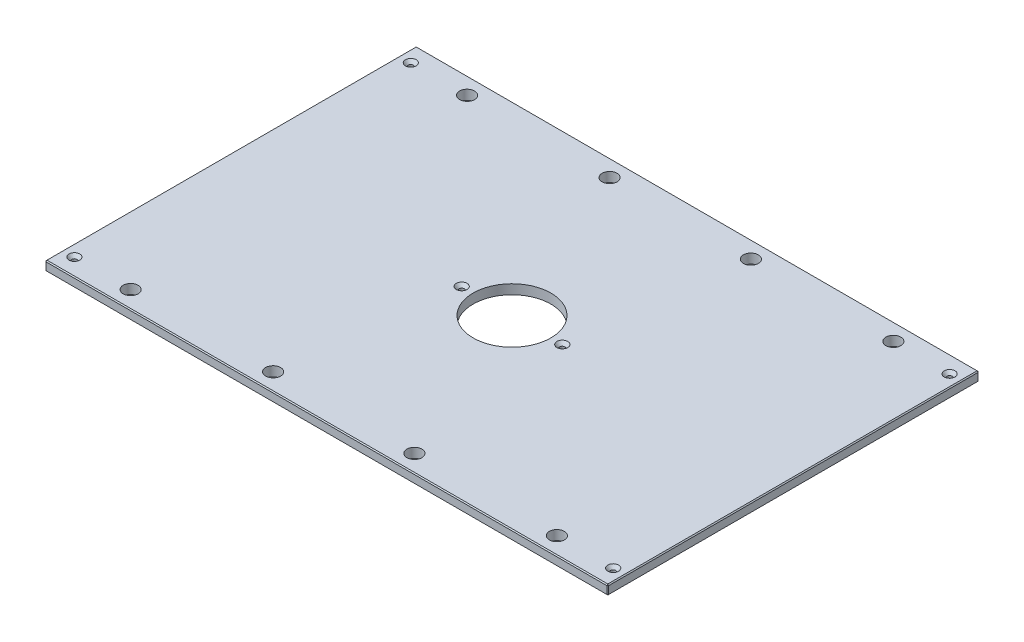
ISO-10303-21;
HEADER;
FILE_DESCRIPTION(('STEP AP214'),'2;1');
FILE_NAME('part.step','',(''),(''),'','','');
FILE_SCHEMA(('AUTOMOTIVE_DESIGN { 1 0 10303 214 1 1 1 1 }'));
ENDSEC;
DATA;
#1=APPLICATION_CONTEXT('core data for automotive mechanical design processes');
#2=APPLICATION_PROTOCOL_DEFINITION('international standard','automotive_design',2000,#1);
#3=PRODUCT_CONTEXT('',#1,'mechanical');
#4=PRODUCT('Part','Part','',(#3));
#5=PRODUCT_RELATED_PRODUCT_CATEGORY('part','',(#4));
#6=PRODUCT_DEFINITION_FORMATION('','',#4);
#7=PRODUCT_DEFINITION_CONTEXT('part definition',#1,'design');
#8=PRODUCT_DEFINITION('design','',#6,#7);
#9=PRODUCT_DEFINITION_SHAPE('','',#8);
#10=(LENGTH_UNIT() NAMED_UNIT(*) SI_UNIT(.MILLI.,.METRE.));
#11=(NAMED_UNIT(*) PLANE_ANGLE_UNIT() SI_UNIT($,.RADIAN.));
#12=(NAMED_UNIT(*) SI_UNIT($,.STERADIAN.) SOLID_ANGLE_UNIT());
#13=UNCERTAINTY_MEASURE_WITH_UNIT(LENGTH_MEASURE(1.E-05),#10,'distance_accuracy_value','');
#14=(GEOMETRIC_REPRESENTATION_CONTEXT(3) GLOBAL_UNCERTAINTY_ASSIGNED_CONTEXT((#13)) GLOBAL_UNIT_ASSIGNED_CONTEXT((#10,
#11,#12)) REPRESENTATION_CONTEXT('',''));
#15=CARTESIAN_POINT('',(0.,0.,0.));
#16=DIRECTION('',(0.,0.,1.));
#17=DIRECTION('',(1.,0.,0.));
#18=AXIS2_PLACEMENT_3D('',#15,#16,#17);
#19=CARTESIAN_POINT('',(-373.0625,12.7,-246.0625));
#20=DIRECTION('',(1.,0.,0.));
#21=DIRECTION('',(0.,0.,-1.));
#22=AXIS2_PLACEMENT_3D('',#19,#20,#21);
#23=PLANE('',#22);
#24=DIRECTION('',(0.,0.,-1.));
#25=VECTOR('',#24,1.);
#26=CARTESIAN_POINT('',(-373.0625,11.43,-246.0625));
#27=LINE('',#26,#25);
#28=CARTESIAN_POINT('',(-373.0625,11.43,244.7925));
#29=VERTEX_POINT('',#28);
#30=CARTESIAN_POINT('',(-373.0625,11.43,-244.7925));
#31=VERTEX_POINT('',#30);
#32=EDGE_CURVE('E135',#29,#31,#27,.T.);
#33=ORIENTED_EDGE('',*,*,#32,.T.);
#34=DIRECTION('',(0.,-1.,0.));
#35=VECTOR('',#34,1.);
#36=CARTESIAN_POINT('',(-373.0625,12.7,-244.7925));
#37=LINE('',#36,#35);
#38=CARTESIAN_POINT('',(-373.0625,1.26999999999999,-244.7925));
#39=VERTEX_POINT('',#38);
#40=EDGE_CURVE('E131',#31,#39,#37,.T.);
#41=ORIENTED_EDGE('',*,*,#40,.T.);
#42=DIRECTION('',(0.,0.,1.));
#43=VECTOR('',#42,1.);
#44=CARTESIAN_POINT('',(-373.0625,1.26999999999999,-246.0625));
#45=LINE('',#44,#43);
#46=CARTESIAN_POINT('',(-373.0625,1.26999999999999,244.7925));
#47=VERTEX_POINT('',#46);
#48=EDGE_CURVE('E126',#39,#47,#45,.T.);
#49=ORIENTED_EDGE('',*,*,#48,.T.);
#50=DIRECTION('',(0.,1.,0.));
#51=VECTOR('',#50,1.);
#52=CARTESIAN_POINT('',(-373.0625,12.7,244.7925));
#53=LINE('',#52,#51);
#54=EDGE_CURVE('E128',#47,#29,#53,.T.);
#55=ORIENTED_EDGE('',*,*,#54,.T.);
#56=EDGE_LOOP('',(#33,#41,#49,#55));
#57=FACE_BOUND('',#56,.T.);
#58=ADVANCED_FACE('F35',(#57),#23,.F.);
#59=CARTESIAN_POINT('',(-373.0625,12.7,246.0625));
#60=DIRECTION('',(0.,0.,-1.));
#61=DIRECTION('',(-1.,0.,0.));
#62=AXIS2_PLACEMENT_3D('',#59,#60,#61);
#63=PLANE('',#62);
#64=DIRECTION('',(1.,0.,0.));
#65=VECTOR('',#64,1.);
#66=CARTESIAN_POINT('',(-373.0625,1.26999999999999,246.0625));
#67=LINE('',#66,#65);
#68=CARTESIAN_POINT('',(-371.7925,1.26999999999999,246.0625));
#69=VERTEX_POINT('',#68);
#70=CARTESIAN_POINT('',(371.7925,1.26999999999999,246.0625));
#71=VERTEX_POINT('',#70);
#72=EDGE_CURVE('E58',#69,#71,#67,.T.);
#73=ORIENTED_EDGE('',*,*,#72,.T.);
#74=DIRECTION('',(0.,1.,0.));
#75=VECTOR('',#74,1.);
#76=CARTESIAN_POINT('',(371.7925,12.7,246.0625));
#77=LINE('',#76,#75);
#78=CARTESIAN_POINT('',(371.7925,11.43,246.0625));
#79=VERTEX_POINT('',#78);
#80=EDGE_CURVE('E11',#71,#79,#77,.T.);
#81=ORIENTED_EDGE('',*,*,#80,.T.);
#82=DIRECTION('',(-1.,0.,0.));
#83=VECTOR('',#82,1.);
#84=CARTESIAN_POINT('',(-373.0625,11.43,246.0625));
#85=LINE('',#84,#83);
#86=CARTESIAN_POINT('',(-371.7925,11.43,246.0625));
#87=VERTEX_POINT('',#86);
#88=EDGE_CURVE('E44',#79,#87,#85,.T.);
#89=ORIENTED_EDGE('',*,*,#88,.T.);
#90=DIRECTION('',(0.,-1.,0.));
#91=VECTOR('',#90,1.);
#92=CARTESIAN_POINT('',(-371.7925,12.7,246.0625));
#93=LINE('',#92,#91);
#94=EDGE_CURVE('E303',#87,#69,#93,.T.);
#95=ORIENTED_EDGE('',*,*,#94,.T.);
#96=EDGE_LOOP('',(#73,#81,#89,#95));
#97=FACE_BOUND('',#96,.T.);
#98=ADVANCED_FACE('F372',(#97),#63,.F.);
#99=CARTESIAN_POINT('',(373.0625,12.7,-246.0625));
#100=DIRECTION('',(-1.,0.,0.));
#101=DIRECTION('',(0.,0.,1.));
#102=AXIS2_PLACEMENT_3D('',#99,#100,#101);
#103=PLANE('',#102);
#104=DIRECTION('',(0.,0.,-1.));
#105=VECTOR('',#104,1.);
#106=CARTESIAN_POINT('',(373.0625,1.26999999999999,-246.0625));
#107=LINE('',#106,#105);
#108=CARTESIAN_POINT('',(373.0625,1.26999999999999,244.7925));
#109=VERTEX_POINT('',#108);
#110=CARTESIAN_POINT('',(373.0625,1.26999999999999,-244.7925));
#111=VERTEX_POINT('',#110);
#112=EDGE_CURVE('E298',#109,#111,#107,.T.);
#113=ORIENTED_EDGE('',*,*,#112,.T.);
#114=DIRECTION('',(0.,1.,0.));
#115=VECTOR('',#114,1.);
#116=CARTESIAN_POINT('',(373.0625,12.7,-244.7925));
#117=LINE('',#116,#115);
#118=CARTESIAN_POINT('',(373.0625,11.43,-244.7925));
#119=VERTEX_POINT('',#118);
#120=EDGE_CURVE('E300',#111,#119,#117,.T.);
#121=ORIENTED_EDGE('',*,*,#120,.T.);
#122=DIRECTION('',(0.,0.,1.));
#123=VECTOR('',#122,1.);
#124=CARTESIAN_POINT('',(373.0625,11.43,246.0625));
#125=LINE('',#124,#123);
#126=CARTESIAN_POINT('',(373.0625,11.43,244.7925));
#127=VERTEX_POINT('',#126);
#128=EDGE_CURVE('E296',#119,#127,#125,.T.);
#129=ORIENTED_EDGE('',*,*,#128,.T.);
#130=DIRECTION('',(0.,-1.,0.));
#131=VECTOR('',#130,1.);
#132=CARTESIAN_POINT('',(373.0625,12.7,244.7925));
#133=LINE('',#132,#131);
#134=EDGE_CURVE('E294',#127,#109,#133,.T.);
#135=ORIENTED_EDGE('',*,*,#134,.T.);
#136=EDGE_LOOP('',(#113,#121,#129,#135));
#137=FACE_BOUND('',#136,.T.);
#138=ADVANCED_FACE('F359',(#137),#103,.F.);
#139=CARTESIAN_POINT('',(-373.0625,12.7,-246.0625));
#140=DIRECTION('',(0.,0.,1.));
#141=DIRECTION('',(1.,0.,0.));
#142=AXIS2_PLACEMENT_3D('',#139,#140,#141);
#143=PLANE('',#142);
#144=DIRECTION('',(-1.,0.,0.));
#145=VECTOR('',#144,1.);
#146=CARTESIAN_POINT('',(-373.0625,1.26999999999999,-246.0625));
#147=LINE('',#146,#145);
#148=CARTESIAN_POINT('',(371.7925,1.26999999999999,-246.0625));
#149=VERTEX_POINT('',#148);
#150=CARTESIAN_POINT('',(-371.7925,1.26999999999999,-246.0625));
#151=VERTEX_POINT('',#150);
#152=EDGE_CURVE('E270',#149,#151,#147,.T.);
#153=ORIENTED_EDGE('',*,*,#152,.T.);
#154=DIRECTION('',(0.,1.,0.));
#155=VECTOR('',#154,1.);
#156=CARTESIAN_POINT('',(-371.7925,12.7,-246.0625));
#157=LINE('',#156,#155);
#158=CARTESIAN_POINT('',(-371.7925,11.43,-246.0625));
#159=VERTEX_POINT('',#158);
#160=EDGE_CURVE('E274',#151,#159,#157,.T.);
#161=ORIENTED_EDGE('',*,*,#160,.T.);
#162=DIRECTION('',(1.,0.,0.));
#163=VECTOR('',#162,1.);
#164=CARTESIAN_POINT('',(373.0625,11.43,-246.0625));
#165=LINE('',#164,#163);
#166=CARTESIAN_POINT('',(371.7925,11.43,-246.0625));
#167=VERTEX_POINT('',#166);
#168=EDGE_CURVE('E272',#159,#167,#165,.T.);
#169=ORIENTED_EDGE('',*,*,#168,.T.);
#170=DIRECTION('',(0.,-1.,0.));
#171=VECTOR('',#170,1.);
#172=CARTESIAN_POINT('',(371.7925,12.7,-246.0625));
#173=LINE('',#172,#171);
#174=EDGE_CURVE('E268',#167,#149,#173,.T.);
#175=ORIENTED_EDGE('',*,*,#174,.T.);
#176=EDGE_LOOP('',(#153,#161,#169,#175));
#177=FACE_BOUND('',#176,.T.);
#178=ADVANCED_FACE('F333',(#177),#143,.F.);
#179=CARTESIAN_POINT('',(0.,12.7,0.));
#180=DIRECTION('',(0.,1.,0.));
#181=DIRECTION('',(0.,0.,1.));
#182=AXIS2_PLACEMENT_3D('',#179,#180,#181);
#183=PLANE('',#182);
#184=CARTESIAN_POINT('',(357.1875,12.7,-223.04248));
#185=DIRECTION('',(0.,1.,0.));
#186=DIRECTION('',(0.,0.,1.));
#187=AXIS2_PLACEMENT_3D('',#184,#185,#186);
#188=CIRCLE('',#187,7.13740000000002);
#189=CARTESIAN_POINT('',(357.1875,12.7,-215.90508));
#190=VERTEX_POINT('',#189);
#191=EDGE_CURVE('E816',#190,#190,#188,.T.);
#192=ORIENTED_EDGE('',*,*,#191,.F.);
#193=EDGE_LOOP('',(#192));
#194=FACE_BOUND('',#193,.T.);
#195=CARTESIAN_POINT('',(357.1875,12.7,223.04248));
#196=DIRECTION('',(0.,1.,0.));
#197=DIRECTION('',(0.,0.,1.));
#198=AXIS2_PLACEMENT_3D('',#195,#196,#197);
#199=CIRCLE('',#198,7.13740000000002);
#200=CARTESIAN_POINT('',(357.1875,12.7,230.17988));
#201=VERTEX_POINT('',#200);
#202=EDGE_CURVE('E820',#201,#201,#199,.T.);
#203=ORIENTED_EDGE('',*,*,#202,.F.);
#204=EDGE_LOOP('',(#203));
#205=FACE_BOUND('',#204,.T.);
#206=CARTESIAN_POINT('',(-357.1875,12.7,223.04248));
#207=DIRECTION('',(0.,1.,0.));
#208=DIRECTION('',(0.,0.,1.));
#209=AXIS2_PLACEMENT_3D('',#206,#207,#208);
#210=CIRCLE('',#209,7.13740000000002);
#211=CARTESIAN_POINT('',(-357.1875,12.7,230.17988));
#212=VERTEX_POINT('',#211);
#213=EDGE_CURVE('E824',#212,#212,#210,.T.);
#214=ORIENTED_EDGE('',*,*,#213,.F.);
#215=EDGE_LOOP('',(#214));
#216=FACE_BOUND('',#215,.T.);
#217=CARTESIAN_POINT('',(-66.675,12.7,0.));
#218=DIRECTION('',(0.,1.,0.));
#219=DIRECTION('',(0.,0.,1.));
#220=AXIS2_PLACEMENT_3D('',#217,#218,#219);
#221=CIRCLE('',#220,7.1374);
#222=CARTESIAN_POINT('',(-66.675,12.7,7.1374));
#223=VERTEX_POINT('',#222);
#224=EDGE_CURVE('E828',#223,#223,#221,.T.);
#225=ORIENTED_EDGE('',*,*,#224,.F.);
#226=EDGE_LOOP('',(#225));
#227=FACE_BOUND('',#226,.T.);
#228=CARTESIAN_POINT('',(66.675,12.7,0.));
#229=DIRECTION('',(0.,1.,0.));
#230=DIRECTION('',(0.,0.,1.));
#231=AXIS2_PLACEMENT_3D('',#228,#229,#230);
#232=CIRCLE('',#231,7.1374);
#233=CARTESIAN_POINT('',(66.675,12.7,7.1374));
#234=VERTEX_POINT('',#233);
#235=EDGE_CURVE('E832',#234,#234,#232,.T.);
#236=ORIENTED_EDGE('',*,*,#235,.F.);
#237=EDGE_LOOP('',(#236));
#238=FACE_BOUND('',#237,.T.);
#239=CARTESIAN_POINT('',(-357.1875,12.7,-223.04248));
#240=DIRECTION('',(0.,1.,0.));
#241=DIRECTION('',(0.,0.,1.));
#242=AXIS2_PLACEMENT_3D('',#239,#240,#241);
#243=CIRCLE('',#242,7.13740000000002);
#244=CARTESIAN_POINT('',(-357.1875,12.7,-215.90508));
#245=VERTEX_POINT('',#244);
#246=EDGE_CURVE('E835',#245,#245,#243,.T.);
#247=ORIENTED_EDGE('',*,*,#246,.F.);
#248=EDGE_LOOP('',(#247));
#249=FACE_BOUND('',#248,.T.);
#250=DIRECTION('',(0.,0.,-1.));
#251=VECTOR('',#250,1.);
#252=CARTESIAN_POINT('',(371.7925,12.7,-246.0625));
#253=LINE('',#252,#251);
#254=CARTESIAN_POINT('',(371.7925,12.7,244.7925));
#255=VERTEX_POINT('',#254);
#256=CARTESIAN_POINT('',(371.7925,12.7,-244.7925));
#257=VERTEX_POINT('',#256);
#258=EDGE_CURVE('E281',#255,#257,#253,.T.);
#259=ORIENTED_EDGE('',*,*,#258,.T.);
#260=DIRECTION('',(-1.,0.,0.));
#261=VECTOR('',#260,1.);
#262=CARTESIAN_POINT('',(-373.0625,12.7,-244.7925));
#263=LINE('',#262,#261);
#264=CARTESIAN_POINT('',(-371.7925,12.7,-244.7925));
#265=VERTEX_POINT('',#264);
#266=EDGE_CURVE('E283',#257,#265,#263,.T.);
#267=ORIENTED_EDGE('',*,*,#266,.T.);
#268=DIRECTION('',(0.,0.,1.));
#269=VECTOR('',#268,1.);
#270=CARTESIAN_POINT('',(-371.7925,12.7,246.0625));
#271=LINE('',#270,#269);
#272=CARTESIAN_POINT('',(-371.7925,12.7,244.7925));
#273=VERTEX_POINT('',#272);
#274=EDGE_CURVE('E279',#265,#273,#271,.T.);
#275=ORIENTED_EDGE('',*,*,#274,.T.);
#276=DIRECTION('',(1.,0.,0.));
#277=VECTOR('',#276,1.);
#278=CARTESIAN_POINT('',(373.0625,12.7,244.7925));
#279=LINE('',#278,#277);
#280=EDGE_CURVE('E277',#273,#255,#279,.T.);
#281=ORIENTED_EDGE('',*,*,#280,.T.);
#282=EDGE_LOOP('',(#259,#267,#275,#281));
#283=FACE_BOUND('',#282,.T.);
#284=CARTESIAN_POINT('',(282.575,12.7,-223.04248));
#285=DIRECTION('',(0.,1.,0.));
#286=DIRECTION('',(0.,0.,1.));
#287=AXIS2_PLACEMENT_3D('',#284,#285,#286);
#288=CIRCLE('',#287,9.92187500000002);
#289=CARTESIAN_POINT('',(282.575,12.7,-213.120605));
#290=VERTEX_POINT('',#289);
#291=EDGE_CURVE('E204',#290,#290,#288,.T.);
#292=ORIENTED_EDGE('',*,*,#291,.F.);
#293=EDGE_LOOP('',(#292));
#294=FACE_BOUND('',#293,.T.);
#295=CARTESIAN_POINT('',(-282.575,12.7,-223.04248));
#296=DIRECTION('',(0.,1.,0.));
#297=DIRECTION('',(0.,0.,1.));
#298=AXIS2_PLACEMENT_3D('',#295,#296,#297);
#299=CIRCLE('',#298,9.92187500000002);
#300=CARTESIAN_POINT('',(-282.575,12.7,-213.120605));
#301=VERTEX_POINT('',#300);
#302=EDGE_CURVE('E214',#301,#301,#299,.T.);
#303=ORIENTED_EDGE('',*,*,#302,.F.);
#304=EDGE_LOOP('',(#303));
#305=FACE_BOUND('',#304,.T.);
#306=CARTESIAN_POINT('',(282.575,12.7,223.04248));
#307=DIRECTION('',(0.,1.,0.));
#308=DIRECTION('',(0.,0.,1.));
#309=AXIS2_PLACEMENT_3D('',#306,#307,#308);
#310=CIRCLE('',#309,9.92187500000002);
#311=CARTESIAN_POINT('',(282.575,12.7,232.964355));
#312=VERTEX_POINT('',#311);
#313=EDGE_CURVE('E225',#312,#312,#310,.T.);
#314=ORIENTED_EDGE('',*,*,#313,.F.);
#315=EDGE_LOOP('',(#314));
#316=FACE_BOUND('',#315,.T.);
#317=CARTESIAN_POINT('',(-282.575,12.7,223.04248));
#318=DIRECTION('',(0.,1.,0.));
#319=DIRECTION('',(0.,0.,1.));
#320=AXIS2_PLACEMENT_3D('',#317,#318,#319);
#321=CIRCLE('',#320,9.92187500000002);
#322=CARTESIAN_POINT('',(-282.575,12.7,232.964355));
#323=VERTEX_POINT('',#322);
#324=EDGE_CURVE('E231',#323,#323,#321,.T.);
#325=ORIENTED_EDGE('',*,*,#324,.F.);
#326=EDGE_LOOP('',(#325));
#327=FACE_BOUND('',#326,.T.);
#328=CARTESIAN_POINT('',(-93.6625,12.7,-223.04248));
#329=DIRECTION('',(0.,1.,0.));
#330=DIRECTION('',(0.,0.,1.));
#331=AXIS2_PLACEMENT_3D('',#328,#329,#330);
#332=CIRCLE('',#331,9.921875);
#333=CARTESIAN_POINT('',(-93.6625,12.7,-213.120605));
#334=VERTEX_POINT('',#333);
#335=EDGE_CURVE('E237',#334,#334,#332,.T.);
#336=ORIENTED_EDGE('',*,*,#335,.F.);
#337=EDGE_LOOP('',(#336));
#338=FACE_BOUND('',#337,.T.);
#339=CARTESIAN_POINT('',(93.6625,12.7,-223.04248));
#340=DIRECTION('',(0.,1.,0.));
#341=DIRECTION('',(0.,0.,1.));
#342=AXIS2_PLACEMENT_3D('',#339,#340,#341);
#343=CIRCLE('',#342,9.921875);
#344=CARTESIAN_POINT('',(93.6625,12.7,-213.120605));
#345=VERTEX_POINT('',#344);
#346=EDGE_CURVE('E243',#345,#345,#343,.T.);
#347=ORIENTED_EDGE('',*,*,#346,.F.);
#348=EDGE_LOOP('',(#347));
#349=FACE_BOUND('',#348,.T.);
#350=CARTESIAN_POINT('',(93.6625,12.7,223.04248));
#351=DIRECTION('',(0.,1.,0.));
#352=DIRECTION('',(0.,0.,1.));
#353=AXIS2_PLACEMENT_3D('',#350,#351,#352);
#354=CIRCLE('',#353,9.921875);
#355=CARTESIAN_POINT('',(93.6625,12.7,232.964355));
#356=VERTEX_POINT('',#355);
#357=EDGE_CURVE('E249',#356,#356,#354,.T.);
#358=ORIENTED_EDGE('',*,*,#357,.F.);
#359=EDGE_LOOP('',(#358));
#360=FACE_BOUND('',#359,.T.);
#361=CARTESIAN_POINT('',(-93.6625,12.7,223.04248));
#362=DIRECTION('',(0.,1.,0.));
#363=DIRECTION('',(0.,0.,1.));
#364=AXIS2_PLACEMENT_3D('',#361,#362,#363);
#365=CIRCLE('',#364,9.921875);
#366=CARTESIAN_POINT('',(-93.6625,12.7,232.964355));
#367=VERTEX_POINT('',#366);
#368=EDGE_CURVE('E255',#367,#367,#365,.T.);
#369=ORIENTED_EDGE('',*,*,#368,.F.);
#370=EDGE_LOOP('',(#369));
#371=FACE_BOUND('',#370,.T.);
#372=CARTESIAN_POINT('',(0.,12.7,0.));
#373=DIRECTION('',(0.,1.,0.));
#374=DIRECTION('',(0.,0.,1.));
#375=AXIS2_PLACEMENT_3D('',#372,#373,#374);
#376=CIRCLE('',#375,51.562);
#377=CARTESIAN_POINT('',(0.,12.7,51.562));
#378=VERTEX_POINT('',#377);
#379=EDGE_CURVE('E261',#378,#378,#376,.T.);
#380=ORIENTED_EDGE('',*,*,#379,.F.);
#381=EDGE_LOOP('',(#380));
#382=FACE_BOUND('',#381,.T.);
#383=ADVANCED_FACE('F381',(#194,#205,#216,#227,#238,#249,#283,#294,#305,#316,#327,#338,#349,
#360,#371,#382),#183,.T.);
#384=CARTESIAN_POINT('',(0.,0.,0.));
#385=DIRECTION('',(0.,1.,0.));
#386=DIRECTION('',(0.,0.,1.));
#387=AXIS2_PLACEMENT_3D('',#384,#385,#386);
#388=PLANE('',#387);
#389=CARTESIAN_POINT('',(357.1875,0.,-223.04248));
#390=DIRECTION('',(0.,1.,0.));
#391=DIRECTION('',(0.,0.,1.));
#392=AXIS2_PLACEMENT_3D('',#389,#390,#391);
#393=CIRCLE('',#392,3.3782);
#394=CARTESIAN_POINT('',(357.1875,0.,-219.66428));
#395=VERTEX_POINT('',#394);
#396=EDGE_CURVE('E869',#395,#395,#393,.T.);
#397=ORIENTED_EDGE('',*,*,#396,.T.);
#398=EDGE_LOOP('',(#397));
#399=FACE_BOUND('',#398,.T.);
#400=CARTESIAN_POINT('',(357.1875,0.,223.04248));
#401=DIRECTION('',(0.,1.,0.));
#402=DIRECTION('',(0.,0.,1.));
#403=AXIS2_PLACEMENT_3D('',#400,#401,#402);
#404=CIRCLE('',#403,3.3782);
#405=CARTESIAN_POINT('',(357.1875,0.,226.42068));
#406=VERTEX_POINT('',#405);
#407=EDGE_CURVE('E862',#406,#406,#404,.T.);
#408=ORIENTED_EDGE('',*,*,#407,.T.);
#409=EDGE_LOOP('',(#408));
#410=FACE_BOUND('',#409,.T.);
#411=CARTESIAN_POINT('',(-357.1875,0.,223.04248));
#412=DIRECTION('',(0.,1.,0.));
#413=DIRECTION('',(0.,0.,1.));
#414=AXIS2_PLACEMENT_3D('',#411,#412,#413);
#415=CIRCLE('',#414,3.3782);
#416=CARTESIAN_POINT('',(-357.1875,0.,226.42068));
#417=VERTEX_POINT('',#416);
#418=EDGE_CURVE('E855',#417,#417,#415,.T.);
#419=ORIENTED_EDGE('',*,*,#418,.T.);
#420=EDGE_LOOP('',(#419));
#421=FACE_BOUND('',#420,.T.);
#422=CARTESIAN_POINT('',(-66.675,0.,0.));
#423=DIRECTION('',(0.,1.,0.));
#424=DIRECTION('',(0.,0.,1.));
#425=AXIS2_PLACEMENT_3D('',#422,#423,#424);
#426=CIRCLE('',#425,3.3782);
#427=CARTESIAN_POINT('',(-66.675,0.,3.3782));
#428=VERTEX_POINT('',#427);
#429=EDGE_CURVE('E848',#428,#428,#426,.T.);
#430=ORIENTED_EDGE('',*,*,#429,.T.);
#431=EDGE_LOOP('',(#430));
#432=FACE_BOUND('',#431,.T.);
#433=CARTESIAN_POINT('',(66.675,0.,0.));
#434=DIRECTION('',(0.,1.,0.));
#435=DIRECTION('',(0.,0.,1.));
#436=AXIS2_PLACEMENT_3D('',#433,#434,#435);
#437=CIRCLE('',#436,3.3782);
#438=CARTESIAN_POINT('',(66.675,0.,3.3782));
#439=VERTEX_POINT('',#438);
#440=EDGE_CURVE('E838',#439,#439,#437,.T.);
#441=ORIENTED_EDGE('',*,*,#440,.T.);
#442=EDGE_LOOP('',(#441));
#443=FACE_BOUND('',#442,.T.);
#444=CARTESIAN_POINT('',(-357.1875,0.,-223.04248));
#445=DIRECTION('',(0.,1.,0.));
#446=DIRECTION('',(0.,0.,1.));
#447=AXIS2_PLACEMENT_3D('',#444,#445,#446);
#448=CIRCLE('',#447,3.3782);
#449=CARTESIAN_POINT('',(-357.1875,0.,-219.66428));
#450=VERTEX_POINT('',#449);
#451=EDGE_CURVE('E217',#450,#450,#448,.T.);
#452=ORIENTED_EDGE('',*,*,#451,.T.);
#453=EDGE_LOOP('',(#452));
#454=FACE_BOUND('',#453,.T.);
#455=DIRECTION('',(0.,0.,-1.));
#456=VECTOR('',#455,1.);
#457=CARTESIAN_POINT('',(-371.7925,0.,0.));
#458=LINE('',#457,#456);
#459=CARTESIAN_POINT('',(-371.7925,0.,244.7925));
#460=VERTEX_POINT('',#459);
#461=CARTESIAN_POINT('',(-371.7925,0.,-244.7925));
#462=VERTEX_POINT('',#461);
#463=EDGE_CURVE('E158',#460,#462,#458,.T.);
#464=ORIENTED_EDGE('',*,*,#463,.T.);
#465=DIRECTION('',(1.,0.,0.));
#466=VECTOR('',#465,1.);
#467=CARTESIAN_POINT('',(0.,0.,-244.7925));
#468=LINE('',#467,#466);
#469=CARTESIAN_POINT('',(371.7925,0.,-244.7925));
#470=VERTEX_POINT('',#469);
#471=EDGE_CURVE('E291',#462,#470,#468,.T.);
#472=ORIENTED_EDGE('',*,*,#471,.T.);
#473=DIRECTION('',(0.,0.,1.));
#474=VECTOR('',#473,1.);
#475=CARTESIAN_POINT('',(371.7925,0.,0.));
#476=LINE('',#475,#474);
#477=CARTESIAN_POINT('',(371.7925,0.,244.7925));
#478=VERTEX_POINT('',#477);
#479=EDGE_CURVE('E289',#470,#478,#476,.T.);
#480=ORIENTED_EDGE('',*,*,#479,.T.);
#481=DIRECTION('',(-1.,0.,0.));
#482=VECTOR('',#481,1.);
#483=CARTESIAN_POINT('',(0.,0.,244.7925));
#484=LINE('',#483,#482);
#485=EDGE_CURVE('E286',#478,#460,#484,.T.);
#486=ORIENTED_EDGE('',*,*,#485,.T.);
#487=EDGE_LOOP('',(#464,#472,#480,#486));
#488=FACE_BOUND('',#487,.T.);
#489=CARTESIAN_POINT('',(282.575,0.,-223.04248));
#490=DIRECTION('',(0.,1.,0.));
#491=DIRECTION('',(0.,0.,1.));
#492=AXIS2_PLACEMENT_3D('',#489,#490,#491);
#493=CIRCLE('',#492,9.92187500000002);
#494=CARTESIAN_POINT('',(282.575,0.,-213.120605));
#495=VERTEX_POINT('',#494);
#496=EDGE_CURVE('E209',#495,#495,#493,.T.);
#497=ORIENTED_EDGE('',*,*,#496,.T.);
#498=EDGE_LOOP('',(#497));
#499=FACE_BOUND('',#498,.T.);
#500=CARTESIAN_POINT('',(-282.575,0.,-223.04248));
#501=DIRECTION('',(0.,1.,0.));
#502=DIRECTION('',(0.,0.,1.));
#503=AXIS2_PLACEMENT_3D('',#500,#501,#502);
#504=CIRCLE('',#503,9.92187500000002);
#505=CARTESIAN_POINT('',(-282.575,0.,-213.120605));
#506=VERTEX_POINT('',#505);
#507=EDGE_CURVE('E222',#506,#506,#504,.T.);
#508=ORIENTED_EDGE('',*,*,#507,.T.);
#509=EDGE_LOOP('',(#508));
#510=FACE_BOUND('',#509,.T.);
#511=CARTESIAN_POINT('',(282.575,0.,223.04248));
#512=DIRECTION('',(0.,1.,0.));
#513=DIRECTION('',(0.,0.,1.));
#514=AXIS2_PLACEMENT_3D('',#511,#512,#513);
#515=CIRCLE('',#514,9.92187500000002);
#516=CARTESIAN_POINT('',(282.575,0.,232.964355));
#517=VERTEX_POINT('',#516);
#518=EDGE_CURVE('E228',#517,#517,#515,.T.);
#519=ORIENTED_EDGE('',*,*,#518,.T.);
#520=EDGE_LOOP('',(#519));
#521=FACE_BOUND('',#520,.T.);
#522=CARTESIAN_POINT('',(-282.575,0.,223.04248));
#523=DIRECTION('',(0.,1.,0.));
#524=DIRECTION('',(0.,0.,1.));
#525=AXIS2_PLACEMENT_3D('',#522,#523,#524);
#526=CIRCLE('',#525,9.92187500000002);
#527=CARTESIAN_POINT('',(-282.575,0.,232.964355));
#528=VERTEX_POINT('',#527);
#529=EDGE_CURVE('E234',#528,#528,#526,.T.);
#530=ORIENTED_EDGE('',*,*,#529,.T.);
#531=EDGE_LOOP('',(#530));
#532=FACE_BOUND('',#531,.T.);
#533=CARTESIAN_POINT('',(-93.6625,0.,-223.04248));
#534=DIRECTION('',(0.,1.,0.));
#535=DIRECTION('',(0.,0.,1.));
#536=AXIS2_PLACEMENT_3D('',#533,#534,#535);
#537=CIRCLE('',#536,9.921875);
#538=CARTESIAN_POINT('',(-93.6625,0.,-213.120605));
#539=VERTEX_POINT('',#538);
#540=EDGE_CURVE('E240',#539,#539,#537,.T.);
#541=ORIENTED_EDGE('',*,*,#540,.T.);
#542=EDGE_LOOP('',(#541));
#543=FACE_BOUND('',#542,.T.);
#544=CARTESIAN_POINT('',(93.6625,0.,-223.04248));
#545=DIRECTION('',(0.,1.,0.));
#546=DIRECTION('',(0.,0.,1.));
#547=AXIS2_PLACEMENT_3D('',#544,#545,#546);
#548=CIRCLE('',#547,9.921875);
#549=CARTESIAN_POINT('',(93.6625,0.,-213.120605));
#550=VERTEX_POINT('',#549);
#551=EDGE_CURVE('E246',#550,#550,#548,.T.);
#552=ORIENTED_EDGE('',*,*,#551,.T.);
#553=EDGE_LOOP('',(#552));
#554=FACE_BOUND('',#553,.T.);
#555=CARTESIAN_POINT('',(93.6625,0.,223.04248));
#556=DIRECTION('',(0.,1.,0.));
#557=DIRECTION('',(0.,0.,1.));
#558=AXIS2_PLACEMENT_3D('',#555,#556,#557);
#559=CIRCLE('',#558,9.921875);
#560=CARTESIAN_POINT('',(93.6625,0.,232.964355));
#561=VERTEX_POINT('',#560);
#562=EDGE_CURVE('E252',#561,#561,#559,.T.);
#563=ORIENTED_EDGE('',*,*,#562,.T.);
#564=EDGE_LOOP('',(#563));
#565=FACE_BOUND('',#564,.T.);
#566=CARTESIAN_POINT('',(-93.6625,0.,223.04248));
#567=DIRECTION('',(0.,1.,0.));
#568=DIRECTION('',(0.,0.,1.));
#569=AXIS2_PLACEMENT_3D('',#566,#567,#568);
#570=CIRCLE('',#569,9.921875);
#571=CARTESIAN_POINT('',(-93.6625,0.,232.964355));
#572=VERTEX_POINT('',#571);
#573=EDGE_CURVE('E258',#572,#572,#570,.T.);
#574=ORIENTED_EDGE('',*,*,#573,.T.);
#575=EDGE_LOOP('',(#574));
#576=FACE_BOUND('',#575,.T.);
#577=CARTESIAN_POINT('',(0.,0.,0.));
#578=DIRECTION('',(0.,1.,0.));
#579=DIRECTION('',(0.,0.,1.));
#580=AXIS2_PLACEMENT_3D('',#577,#578,#579);
#581=CIRCLE('',#580,51.562);
#582=CARTESIAN_POINT('',(0.,0.,51.562));
#583=VERTEX_POINT('',#582);
#584=EDGE_CURVE('E147',#583,#583,#581,.T.);
#585=ORIENTED_EDGE('',*,*,#584,.T.);
#586=EDGE_LOOP('',(#585));
#587=FACE_BOUND('',#586,.T.);
#588=ADVANCED_FACE('F346',(#399,#410,#421,#432,#443,#454,#488,#499,#510,#521,#532,#543,#554,
#565,#576,#587),#388,.F.);
#589=CARTESIAN_POINT('',(0.,0.,0.));
#590=DIRECTION('',(0.,1.,0.));
#591=DIRECTION('',(0.,0.,1.));
#592=AXIS2_PLACEMENT_3D('',#589,#590,#591);
#593=CYLINDRICAL_SURFACE('',#592,51.562);
#594=ORIENTED_EDGE('',*,*,#584,.F.);
#595=EDGE_LOOP('',(#594));
#596=FACE_BOUND('',#595,.T.);
#597=ORIENTED_EDGE('',*,*,#379,.T.);
#598=EDGE_LOOP('',(#597));
#599=FACE_BOUND('',#598,.T.);
#600=ADVANCED_FACE('F751',(#596,#599),#593,.F.);
#601=CARTESIAN_POINT('',(-93.6625,12.7,223.04248));
#602=DIRECTION('',(0.,1.,0.));
#603=DIRECTION('',(0.,0.,1.));
#604=AXIS2_PLACEMENT_3D('',#601,#602,#603);
#605=CYLINDRICAL_SURFACE('',#604,9.921875);
#606=ORIENTED_EDGE('',*,*,#573,.F.);
#607=EDGE_LOOP('',(#606));
#608=FACE_BOUND('',#607,.T.);
#609=ORIENTED_EDGE('',*,*,#368,.T.);
#610=EDGE_LOOP('',(#609));
#611=FACE_BOUND('',#610,.T.);
#612=ADVANCED_FACE('F742',(#608,#611),#605,.F.);
#613=CARTESIAN_POINT('',(93.6625,12.7,223.04248));
#614=DIRECTION('',(0.,1.,0.));
#615=DIRECTION('',(0.,0.,1.));
#616=AXIS2_PLACEMENT_3D('',#613,#614,#615);
#617=CYLINDRICAL_SURFACE('',#616,9.921875);
#618=ORIENTED_EDGE('',*,*,#562,.F.);
#619=EDGE_LOOP('',(#618));
#620=FACE_BOUND('',#619,.T.);
#621=ORIENTED_EDGE('',*,*,#357,.T.);
#622=EDGE_LOOP('',(#621));
#623=FACE_BOUND('',#622,.T.);
#624=ADVANCED_FACE('F733',(#620,#623),#617,.F.);
#625=CARTESIAN_POINT('',(93.6625,12.7,-223.04248));
#626=DIRECTION('',(0.,1.,0.));
#627=DIRECTION('',(0.,0.,1.));
#628=AXIS2_PLACEMENT_3D('',#625,#626,#627);
#629=CYLINDRICAL_SURFACE('',#628,9.921875);
#630=ORIENTED_EDGE('',*,*,#551,.F.);
#631=EDGE_LOOP('',(#630));
#632=FACE_BOUND('',#631,.T.);
#633=ORIENTED_EDGE('',*,*,#346,.T.);
#634=EDGE_LOOP('',(#633));
#635=FACE_BOUND('',#634,.T.);
#636=ADVANCED_FACE('F724',(#632,#635),#629,.F.);
#637=CARTESIAN_POINT('',(-93.6625,12.7,-223.04248));
#638=DIRECTION('',(0.,1.,0.));
#639=DIRECTION('',(0.,0.,1.));
#640=AXIS2_PLACEMENT_3D('',#637,#638,#639);
#641=CYLINDRICAL_SURFACE('',#640,9.921875);
#642=ORIENTED_EDGE('',*,*,#540,.F.);
#643=EDGE_LOOP('',(#642));
#644=FACE_BOUND('',#643,.T.);
#645=ORIENTED_EDGE('',*,*,#335,.T.);
#646=EDGE_LOOP('',(#645));
#647=FACE_BOUND('',#646,.T.);
#648=ADVANCED_FACE('F715',(#644,#647),#641,.F.);
#649=CARTESIAN_POINT('',(-282.575,12.7,223.04248));
#650=DIRECTION('',(0.,1.,0.));
#651=DIRECTION('',(0.,0.,1.));
#652=AXIS2_PLACEMENT_3D('',#649,#650,#651);
#653=CYLINDRICAL_SURFACE('',#652,9.92187500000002);
#654=ORIENTED_EDGE('',*,*,#529,.F.);
#655=EDGE_LOOP('',(#654));
#656=FACE_BOUND('',#655,.T.);
#657=ORIENTED_EDGE('',*,*,#324,.T.);
#658=EDGE_LOOP('',(#657));
#659=FACE_BOUND('',#658,.T.);
#660=ADVANCED_FACE('F706',(#656,#659),#653,.F.);
#661=CARTESIAN_POINT('',(282.575,12.7,223.04248));
#662=DIRECTION('',(0.,1.,0.));
#663=DIRECTION('',(0.,0.,1.));
#664=AXIS2_PLACEMENT_3D('',#661,#662,#663);
#665=CYLINDRICAL_SURFACE('',#664,9.92187500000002);
#666=ORIENTED_EDGE('',*,*,#518,.F.);
#667=EDGE_LOOP('',(#666));
#668=FACE_BOUND('',#667,.T.);
#669=ORIENTED_EDGE('',*,*,#313,.T.);
#670=EDGE_LOOP('',(#669));
#671=FACE_BOUND('',#670,.T.);
#672=ADVANCED_FACE('F697',(#668,#671),#665,.F.);
#673=CARTESIAN_POINT('',(-282.575,12.7,-223.04248));
#674=DIRECTION('',(0.,1.,0.));
#675=DIRECTION('',(0.,0.,1.));
#676=AXIS2_PLACEMENT_3D('',#673,#674,#675);
#677=CYLINDRICAL_SURFACE('',#676,9.92187500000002);
#678=ORIENTED_EDGE('',*,*,#507,.F.);
#679=EDGE_LOOP('',(#678));
#680=FACE_BOUND('',#679,.T.);
#681=ORIENTED_EDGE('',*,*,#302,.T.);
#682=EDGE_LOOP('',(#681));
#683=FACE_BOUND('',#682,.T.);
#684=ADVANCED_FACE('F687',(#680,#683),#677,.F.);
#685=CARTESIAN_POINT('',(282.575,12.7,-223.04248));
#686=DIRECTION('',(0.,1.,0.));
#687=DIRECTION('',(0.,0.,1.));
#688=AXIS2_PLACEMENT_3D('',#685,#686,#687);
#689=CYLINDRICAL_SURFACE('',#688,9.92187500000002);
#690=ORIENTED_EDGE('',*,*,#496,.F.);
#691=EDGE_LOOP('',(#690));
#692=FACE_BOUND('',#691,.T.);
#693=ORIENTED_EDGE('',*,*,#291,.T.);
#694=EDGE_LOOP('',(#693));
#695=FACE_BOUND('',#694,.T.);
#696=ADVANCED_FACE('F390',(#692,#695),#689,.F.);
#697=CARTESIAN_POINT('',(373.0625,12.7,244.7925));
#698=DIRECTION('',(-0.707106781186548,0.,-0.707106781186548));
#699=DIRECTION('',(0.,-1.,0.));
#700=AXIS2_PLACEMENT_3D('',#697,#698,#699);
#701=PLANE('',#700);
#702=DIRECTION('',(-0.707106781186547,0.,0.707106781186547));
#703=VECTOR('',#702,1.);
#704=CARTESIAN_POINT('',(373.0625,11.43,244.7925));
#705=LINE('',#704,#703);
#706=EDGE_CURVE('E39',#79,#127,#705,.F.);
#707=ORIENTED_EDGE('',*,*,#706,.F.);
#708=ORIENTED_EDGE('',*,*,#80,.F.);
#709=DIRECTION('',(0.707106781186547,0.,-0.707106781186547));
#710=VECTOR('',#709,1.);
#711=CARTESIAN_POINT('',(372.4275,1.26999999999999,245.4275));
#712=LINE('',#711,#710);
#713=EDGE_CURVE('E197',#109,#71,#712,.F.);
#714=ORIENTED_EDGE('',*,*,#713,.F.);
#715=ORIENTED_EDGE('',*,*,#134,.F.);
#716=EDGE_LOOP('',(#707,#708,#714,#715));
#717=FACE_BOUND('',#716,.T.);
#718=ADVANCED_FACE('F37',(#717),#701,.F.);
#719=CARTESIAN_POINT('',(373.0625,11.43,244.7925));
#720=DIRECTION('',(0.577350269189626,0.577350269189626,0.577350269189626));
#721=DIRECTION('',(0.707106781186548,0.,-0.707106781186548));
#722=AXIS2_PLACEMENT_3D('',#719,#720,#721);
#723=PLANE('',#722);
#724=DIRECTION('',(0.,-0.707106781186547,0.707106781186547));
#725=VECTOR('',#724,1.);
#726=CARTESIAN_POINT('',(371.7925,12.065,245.4275));
#727=LINE('',#726,#725);
#728=EDGE_CURVE('E193',#79,#255,#727,.F.);
#729=ORIENTED_EDGE('',*,*,#728,.F.);
#730=ORIENTED_EDGE('',*,*,#706,.T.);
#731=DIRECTION('',(-0.707106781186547,0.707106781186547,0.));
#732=VECTOR('',#731,1.);
#733=CARTESIAN_POINT('',(373.0625,11.43,244.7925));
#734=LINE('',#733,#732);
#735=EDGE_CURVE('E195',#255,#127,#734,.F.);
#736=ORIENTED_EDGE('',*,*,#735,.F.);
#737=EDGE_LOOP('',(#729,#730,#736));
#738=FACE_BOUND('',#737,.T.);
#739=ADVANCED_FACE('F383',(#738),#723,.T.);
#740=CARTESIAN_POINT('',(371.7925,0.,244.7925));
#741=DIRECTION('',(0.577350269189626,-0.577350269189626,0.577350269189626));
#742=DIRECTION('',(0.707106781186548,0.,-0.707106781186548));
#743=AXIS2_PLACEMENT_3D('',#740,#741,#742);
#744=PLANE('',#743);
#745=DIRECTION('',(-0.707106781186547,-0.707106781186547,0.));
#746=VECTOR('',#745,1.);
#747=CARTESIAN_POINT('',(371.7925,0.,244.7925));
#748=LINE('',#747,#746);
#749=EDGE_CURVE('E187',#109,#478,#748,.T.);
#750=ORIENTED_EDGE('',*,*,#749,.F.);
#751=ORIENTED_EDGE('',*,*,#713,.T.);
#752=DIRECTION('',(0.,0.707106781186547,0.707106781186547));
#753=VECTOR('',#752,1.);
#754=CARTESIAN_POINT('',(371.7925,0.,244.7925));
#755=LINE('',#754,#753);
#756=EDGE_CURVE('E190',#478,#71,#755,.T.);
#757=ORIENTED_EDGE('',*,*,#756,.F.);
#758=EDGE_LOOP('',(#750,#751,#757));
#759=FACE_BOUND('',#758,.T.);
#760=ADVANCED_FACE('F352',(#759),#744,.T.);
#761=CARTESIAN_POINT('',(371.7925,12.7,0.));
#762=DIRECTION('',(0.707106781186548,0.707106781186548,0.));
#763=DIRECTION('',(0.,0.,1.));
#764=AXIS2_PLACEMENT_3D('',#761,#762,#763);
#765=PLANE('',#764);
#766=ORIENTED_EDGE('',*,*,#735,.T.);
#767=ORIENTED_EDGE('',*,*,#128,.F.);
#768=DIRECTION('',(0.707106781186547,-0.707106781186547,0.));
#769=VECTOR('',#768,1.);
#770=CARTESIAN_POINT('',(372.4275,12.065,-244.7925));
#771=LINE('',#770,#769);
#772=EDGE_CURVE('E182',#257,#119,#771,.T.);
#773=ORIENTED_EDGE('',*,*,#772,.F.);
#774=ORIENTED_EDGE('',*,*,#258,.F.);
#775=EDGE_LOOP('',(#766,#767,#773,#774));
#776=FACE_BOUND('',#775,.T.);
#777=ADVANCED_FACE('F369',(#776),#765,.T.);
#778=CARTESIAN_POINT('',(0.,12.7,244.7925));
#779=DIRECTION('',(0.,0.707106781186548,0.707106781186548));
#780=DIRECTION('',(-1.,0.,0.));
#781=AXIS2_PLACEMENT_3D('',#778,#779,#780);
#782=PLANE('',#781);
#783=ORIENTED_EDGE('',*,*,#728,.T.);
#784=ORIENTED_EDGE('',*,*,#280,.F.);
#785=DIRECTION('',(0.,0.707106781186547,-0.707106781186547));
#786=VECTOR('',#785,1.);
#787=CARTESIAN_POINT('',(-371.7925,12.7,244.7925));
#788=LINE('',#787,#786);
#789=EDGE_CURVE('E179',#87,#273,#788,.T.);
#790=ORIENTED_EDGE('',*,*,#789,.F.);
#791=ORIENTED_EDGE('',*,*,#88,.F.);
#792=EDGE_LOOP('',(#783,#784,#790,#791));
#793=FACE_BOUND('',#792,.T.);
#794=ADVANCED_FACE('F374',(#793),#782,.T.);
#795=CARTESIAN_POINT('',(-371.7925,12.7,246.0625));
#796=DIRECTION('',(0.707106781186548,0.,-0.707106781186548));
#797=DIRECTION('',(0.,-1.,0.));
#798=AXIS2_PLACEMENT_3D('',#795,#796,#797);
#799=PLANE('',#798);
#800=DIRECTION('',(0.707106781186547,0.,0.707106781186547));
#801=VECTOR('',#800,1.);
#802=CARTESIAN_POINT('',(-373.0625,1.26999999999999,244.7925));
#803=LINE('',#802,#801);
#804=EDGE_CURVE('E142',#69,#47,#803,.F.);
#805=ORIENTED_EDGE('',*,*,#804,.F.);
#806=ORIENTED_EDGE('',*,*,#94,.F.);
#807=DIRECTION('',(-0.707106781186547,0.,-0.707106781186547));
#808=VECTOR('',#807,1.);
#809=CARTESIAN_POINT('',(-372.4275,11.43,245.4275));
#810=LINE('',#809,#808);
#811=EDGE_CURVE('E145',#29,#87,#810,.F.);
#812=ORIENTED_EDGE('',*,*,#811,.F.);
#813=ORIENTED_EDGE('',*,*,#54,.F.);
#814=EDGE_LOOP('',(#805,#806,#812,#813));
#815=FACE_BOUND('',#814,.T.);
#816=ADVANCED_FACE('F140',(#815),#799,.F.);
#817=CARTESIAN_POINT('',(-373.0625,1.26999999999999,246.0625));
#818=DIRECTION('',(0.,0.707106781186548,-0.707106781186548));
#819=DIRECTION('',(1.,0.,0.));
#820=AXIS2_PLACEMENT_3D('',#817,#818,#819);
#821=PLANE('',#820);
#822=ORIENTED_EDGE('',*,*,#756,.T.);
#823=ORIENTED_EDGE('',*,*,#72,.F.);
#824=DIRECTION('',(0.,-0.707106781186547,-0.707106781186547));
#825=VECTOR('',#824,1.);
#826=CARTESIAN_POINT('',(-371.7925,0.634999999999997,245.4275));
#827=LINE('',#826,#825);
#828=EDGE_CURVE('E155',#460,#69,#827,.F.);
#829=ORIENTED_EDGE('',*,*,#828,.F.);
#830=ORIENTED_EDGE('',*,*,#485,.F.);
#831=EDGE_LOOP('',(#822,#823,#829,#830));
#832=FACE_BOUND('',#831,.T.);
#833=ADVANCED_FACE('F351',(#832),#821,.F.);
#834=CARTESIAN_POINT('',(373.0625,1.26999999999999,-246.0625));
#835=DIRECTION('',(-0.707106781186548,0.707106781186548,0.));
#836=DIRECTION('',(0.,0.,-1.));
#837=AXIS2_PLACEMENT_3D('',#834,#835,#836);
#838=PLANE('',#837);
#839=ORIENTED_EDGE('',*,*,#749,.T.);
#840=ORIENTED_EDGE('',*,*,#479,.F.);
#841=DIRECTION('',(0.707106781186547,0.707106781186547,0.));
#842=VECTOR('',#841,1.);
#843=CARTESIAN_POINT('',(371.7925,0.,-244.7925));
#844=LINE('',#843,#842);
#845=EDGE_CURVE('E174',#111,#470,#844,.F.);
#846=ORIENTED_EDGE('',*,*,#845,.F.);
#847=ORIENTED_EDGE('',*,*,#112,.F.);
#848=EDGE_LOOP('',(#839,#840,#846,#847));
#849=FACE_BOUND('',#848,.T.);
#850=ADVANCED_FACE('F356',(#849),#838,.F.);
#851=CARTESIAN_POINT('',(371.7925,12.7,-246.0625));
#852=DIRECTION('',(-0.707106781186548,0.,0.707106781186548));
#853=DIRECTION('',(0.,-1.,0.));
#854=AXIS2_PLACEMENT_3D('',#851,#852,#853);
#855=PLANE('',#854);
#856=DIRECTION('',(0.707106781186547,0.,0.707106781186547));
#857=VECTOR('',#856,1.);
#858=CARTESIAN_POINT('',(371.7925,11.43,-246.0625));
#859=LINE('',#858,#857);
#860=EDGE_CURVE('E184',#119,#167,#859,.F.);
#861=ORIENTED_EDGE('',*,*,#860,.F.);
#862=ORIENTED_EDGE('',*,*,#120,.F.);
#863=DIRECTION('',(-0.707106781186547,0.,-0.707106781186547));
#864=VECTOR('',#863,1.);
#865=CARTESIAN_POINT('',(372.4275,1.26999999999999,-245.4275));
#866=LINE('',#865,#864);
#867=EDGE_CURVE('E171',#149,#111,#866,.F.);
#868=ORIENTED_EDGE('',*,*,#867,.F.);
#869=ORIENTED_EDGE('',*,*,#174,.F.);
#870=EDGE_LOOP('',(#861,#862,#868,#869));
#871=FACE_BOUND('',#870,.T.);
#872=ADVANCED_FACE('F364',(#871),#855,.F.);
#873=CARTESIAN_POINT('',(371.7925,11.43,-246.0625));
#874=DIRECTION('',(0.577350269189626,0.577350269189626,-0.577350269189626));
#875=DIRECTION('',(-0.707106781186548,0.,-0.707106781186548));
#876=AXIS2_PLACEMENT_3D('',#873,#874,#875);
#877=PLANE('',#876);
#878=ORIENTED_EDGE('',*,*,#772,.T.);
#879=ORIENTED_EDGE('',*,*,#860,.T.);
#880=DIRECTION('',(0.,0.707106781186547,0.707106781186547));
#881=VECTOR('',#880,1.);
#882=CARTESIAN_POINT('',(371.7925,11.43,-246.0625));
#883=LINE('',#882,#881);
#884=EDGE_CURVE('E163',#257,#167,#883,.F.);
#885=ORIENTED_EDGE('',*,*,#884,.F.);
#886=EDGE_LOOP('',(#878,#879,#885));
#887=FACE_BOUND('',#886,.T.);
#888=ADVANCED_FACE('F422',(#887),#877,.T.);
#889=CARTESIAN_POINT('',(-371.7925,12.7,244.7925));
#890=DIRECTION('',(-0.577350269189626,0.577350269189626,0.577350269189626));
#891=DIRECTION('',(0.707106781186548,0.,0.707106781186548));
#892=AXIS2_PLACEMENT_3D('',#889,#890,#891);
#893=PLANE('',#892);
#894=ORIENTED_EDGE('',*,*,#811,.T.);
#895=ORIENTED_EDGE('',*,*,#789,.T.);
#896=DIRECTION('',(-0.707106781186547,-0.707106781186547,0.));
#897=VECTOR('',#896,1.);
#898=CARTESIAN_POINT('',(-371.7925,12.7,244.7925));
#899=LINE('',#898,#897);
#900=EDGE_CURVE('E159',#29,#273,#899,.F.);
#901=ORIENTED_EDGE('',*,*,#900,.F.);
#902=EDGE_LOOP('',(#894,#895,#901));
#903=FACE_BOUND('',#902,.T.);
#904=ADVANCED_FACE('F376',(#903),#893,.T.);
#905=CARTESIAN_POINT('',(-373.0625,1.26999999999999,244.7925));
#906=DIRECTION('',(-0.577350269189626,-0.577350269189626,0.577350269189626));
#907=DIRECTION('',(0.707106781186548,0.,0.707106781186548));
#908=AXIS2_PLACEMENT_3D('',#905,#906,#907);
#909=PLANE('',#908);
#910=ORIENTED_EDGE('',*,*,#828,.T.);
#911=ORIENTED_EDGE('',*,*,#804,.T.);
#912=DIRECTION('',(-0.707106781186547,0.707106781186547,0.));
#913=VECTOR('',#912,1.);
#914=CARTESIAN_POINT('',(-373.0625,1.26999999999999,244.7925));
#915=LINE('',#914,#913);
#916=EDGE_CURVE('E152',#460,#47,#915,.T.);
#917=ORIENTED_EDGE('',*,*,#916,.F.);
#918=EDGE_LOOP('',(#910,#911,#917));
#919=FACE_BOUND('',#918,.T.);
#920=ADVANCED_FACE('F151',(#919),#909,.T.);
#921=CARTESIAN_POINT('',(371.7925,0.,-244.7925));
#922=DIRECTION('',(0.577350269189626,-0.577350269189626,-0.577350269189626));
#923=DIRECTION('',(-0.707106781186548,0.,-0.707106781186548));
#924=AXIS2_PLACEMENT_3D('',#921,#922,#923);
#925=PLANE('',#924);
#926=ORIENTED_EDGE('',*,*,#867,.T.);
#927=ORIENTED_EDGE('',*,*,#845,.T.);
#928=DIRECTION('',(0.,-0.707106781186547,0.707106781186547));
#929=VECTOR('',#928,1.);
#930=CARTESIAN_POINT('',(371.7925,0.,-244.7925));
#931=LINE('',#930,#929);
#932=EDGE_CURVE('E160',#149,#470,#931,.T.);
#933=ORIENTED_EDGE('',*,*,#932,.F.);
#934=EDGE_LOOP('',(#926,#927,#933));
#935=FACE_BOUND('',#934,.T.);
#936=ADVANCED_FACE('F414',(#935),#925,.T.);
#937=CARTESIAN_POINT('',(0.,12.7,-244.7925));
#938=DIRECTION('',(0.,0.707106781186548,-0.707106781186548));
#939=DIRECTION('',(1.,0.,0.));
#940=AXIS2_PLACEMENT_3D('',#937,#938,#939);
#941=PLANE('',#940);
#942=ORIENTED_EDGE('',*,*,#884,.T.);
#943=ORIENTED_EDGE('',*,*,#168,.F.);
#944=DIRECTION('',(0.,-0.707106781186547,-0.707106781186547));
#945=VECTOR('',#944,1.);
#946=CARTESIAN_POINT('',(-371.7925,11.43,-246.0625));
#947=LINE('',#946,#945);
#948=EDGE_CURVE('E165',#265,#159,#947,.T.);
#949=ORIENTED_EDGE('',*,*,#948,.F.);
#950=ORIENTED_EDGE('',*,*,#266,.F.);
#951=EDGE_LOOP('',(#942,#943,#949,#950));
#952=FACE_BOUND('',#951,.T.);
#953=ADVANCED_FACE('F328',(#952),#941,.T.);
#954=CARTESIAN_POINT('',(-371.7925,12.7,0.));
#955=DIRECTION('',(-0.707106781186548,0.707106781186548,0.));
#956=DIRECTION('',(0.,0.,-1.));
#957=AXIS2_PLACEMENT_3D('',#954,#955,#956);
#958=PLANE('',#957);
#959=ORIENTED_EDGE('',*,*,#900,.T.);
#960=ORIENTED_EDGE('',*,*,#274,.F.);
#961=DIRECTION('',(0.707106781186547,0.707106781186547,0.));
#962=VECTOR('',#961,1.);
#963=CARTESIAN_POINT('',(-372.4275,12.065,-244.7925));
#964=LINE('',#963,#962);
#965=EDGE_CURVE('E317',#31,#265,#964,.T.);
#966=ORIENTED_EDGE('',*,*,#965,.F.);
#967=ORIENTED_EDGE('',*,*,#32,.F.);
#968=EDGE_LOOP('',(#959,#960,#966,#967));
#969=FACE_BOUND('',#968,.T.);
#970=ADVANCED_FACE('F379',(#969),#958,.T.);
#971=CARTESIAN_POINT('',(-373.0625,1.26999999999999,-246.0625));
#972=DIRECTION('',(0.707106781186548,0.707106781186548,0.));
#973=DIRECTION('',(0.,0.,1.));
#974=AXIS2_PLACEMENT_3D('',#971,#972,#973);
#975=PLANE('',#974);
#976=ORIENTED_EDGE('',*,*,#916,.T.);
#977=ORIENTED_EDGE('',*,*,#48,.F.);
#978=DIRECTION('',(0.707106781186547,-0.707106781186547,0.));
#979=VECTOR('',#978,1.);
#980=CARTESIAN_POINT('',(-373.0625,1.26999999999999,-244.7925));
#981=LINE('',#980,#979);
#982=EDGE_CURVE('E314',#462,#39,#981,.F.);
#983=ORIENTED_EDGE('',*,*,#982,.F.);
#984=ORIENTED_EDGE('',*,*,#463,.F.);
#985=EDGE_LOOP('',(#976,#977,#983,#984));
#986=FACE_BOUND('',#985,.T.);
#987=ADVANCED_FACE('F157',(#986),#975,.F.);
#988=CARTESIAN_POINT('',(-373.0625,1.26999999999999,-246.0625));
#989=DIRECTION('',(0.,0.707106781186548,0.707106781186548));
#990=DIRECTION('',(-1.,0.,0.));
#991=AXIS2_PLACEMENT_3D('',#988,#989,#990);
#992=PLANE('',#991);
#993=ORIENTED_EDGE('',*,*,#932,.T.);
#994=ORIENTED_EDGE('',*,*,#471,.F.);
#995=DIRECTION('',(0.,0.707106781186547,-0.707106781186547));
#996=VECTOR('',#995,1.);
#997=CARTESIAN_POINT('',(-371.7925,0.634999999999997,-245.4275));
#998=LINE('',#997,#996);
#999=EDGE_CURVE('E311',#151,#462,#998,.F.);
#1000=ORIENTED_EDGE('',*,*,#999,.F.);
#1001=ORIENTED_EDGE('',*,*,#152,.F.);
#1002=EDGE_LOOP('',(#993,#994,#1000,#1001));
#1003=FACE_BOUND('',#1002,.T.);
#1004=ADVANCED_FACE('F343',(#1003),#992,.F.);
#1005=CARTESIAN_POINT('',(-371.7925,11.43,-246.0625));
#1006=DIRECTION('',(-0.577350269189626,0.577350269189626,-0.577350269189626));
#1007=DIRECTION('',(-0.707106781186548,0.,0.707106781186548));
#1008=AXIS2_PLACEMENT_3D('',#1005,#1006,#1007);
#1009=PLANE('',#1008);
#1010=ORIENTED_EDGE('',*,*,#965,.T.);
#1011=ORIENTED_EDGE('',*,*,#948,.T.);
#1012=DIRECTION('',(0.707106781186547,0.,-0.707106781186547));
#1013=VECTOR('',#1012,1.);
#1014=CARTESIAN_POINT('',(-371.7925,11.43,-246.0625));
#1015=LINE('',#1014,#1013);
#1016=EDGE_CURVE('E309',#31,#159,#1015,.T.);
#1017=ORIENTED_EDGE('',*,*,#1016,.F.);
#1018=EDGE_LOOP('',(#1010,#1011,#1017));
#1019=FACE_BOUND('',#1018,.T.);
#1020=ADVANCED_FACE('F323',(#1019),#1009,.T.);
#1021=CARTESIAN_POINT('',(-373.0625,1.26999999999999,-244.7925));
#1022=DIRECTION('',(-0.577350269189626,-0.577350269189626,-0.577350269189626));
#1023=DIRECTION('',(-0.707106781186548,0.,0.707106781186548));
#1024=AXIS2_PLACEMENT_3D('',#1021,#1022,#1023);
#1025=PLANE('',#1024);
#1026=ORIENTED_EDGE('',*,*,#999,.T.);
#1027=ORIENTED_EDGE('',*,*,#982,.T.);
#1028=DIRECTION('',(-0.707106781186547,0.,0.707106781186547));
#1029=VECTOR('',#1028,1.);
#1030=CARTESIAN_POINT('',(-373.0625,1.26999999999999,-244.7925));
#1031=LINE('',#1030,#1029);
#1032=EDGE_CURVE('E307',#151,#39,#1031,.T.);
#1033=ORIENTED_EDGE('',*,*,#1032,.F.);
#1034=EDGE_LOOP('',(#1026,#1027,#1033));
#1035=FACE_BOUND('',#1034,.T.);
#1036=ADVANCED_FACE('F340',(#1035),#1025,.T.);
#1037=CARTESIAN_POINT('',(-373.0625,12.7,-244.7925));
#1038=DIRECTION('',(0.707106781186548,0.,0.707106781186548));
#1039=DIRECTION('',(0.,-1.,0.));
#1040=AXIS2_PLACEMENT_3D('',#1037,#1038,#1039);
#1041=PLANE('',#1040);
#1042=ORIENTED_EDGE('',*,*,#1016,.T.);
#1043=ORIENTED_EDGE('',*,*,#160,.F.);
#1044=ORIENTED_EDGE('',*,*,#1032,.T.);
#1045=ORIENTED_EDGE('',*,*,#40,.F.);
#1046=EDGE_LOOP('',(#1042,#1043,#1044,#1045));
#1047=FACE_BOUND('',#1046,.T.);
#1048=ADVANCED_FACE('F338',(#1047),#1041,.F.);
#1049=CARTESIAN_POINT('',(-357.1875,12.7,-223.04248));
#1050=DIRECTION('',(0.,1.,0.));
#1051=DIRECTION('',(0.,0.,1.));
#1052=AXIS2_PLACEMENT_3D('',#1049,#1050,#1051);
#1053=CYLINDRICAL_SURFACE('',#1052,3.3782);
#1054=ORIENTED_EDGE('',*,*,#451,.F.);
#1055=EDGE_LOOP('',(#1054));
#1056=FACE_BOUND('',#1055,.T.);
#1057=CARTESIAN_POINT('',(-357.1875,8.37553508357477,-223.04248));
#1058=DIRECTION('',(0.,1.,0.));
#1059=DIRECTION('',(0.,0.,1.));
#1060=AXIS2_PLACEMENT_3D('',#1057,#1058,#1059);
#1061=CIRCLE('',#1060,3.3782);
#1062=CARTESIAN_POINT('',(-357.1875,8.37553508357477,-219.66428));
#1063=VERTEX_POINT('',#1062);
#1064=EDGE_CURVE('E837',#1063,#1063,#1061,.T.);
#1065=ORIENTED_EDGE('',*,*,#1064,.T.);
#1066=EDGE_LOOP('',(#1065));
#1067=FACE_BOUND('',#1066,.T.);
#1068=ADVANCED_FACE('F401',(#1056,#1067),#1053,.F.);
#1069=CARTESIAN_POINT('',(-357.1875,12.7,-223.04248));
#1070=DIRECTION('',(0.,1.,0.));
#1071=DIRECTION('',(0.,0.,1.));
#1072=AXIS2_PLACEMENT_3D('',#1069,#1070,#1071);
#1073=CONICAL_SURFACE('',#1072,7.13740000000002,0.715584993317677);
#1074=ORIENTED_EDGE('',*,*,#1064,.F.);
#1075=EDGE_LOOP('',(#1074));
#1076=FACE_BOUND('',#1075,.T.);
#1077=ORIENTED_EDGE('',*,*,#246,.T.);
#1078=EDGE_LOOP('',(#1077));
#1079=FACE_BOUND('',#1078,.T.);
#1080=ADVANCED_FACE('F511',(#1076,#1079),#1073,.F.);
#1081=CARTESIAN_POINT('',(66.675,12.7,0.));
#1082=DIRECTION('',(0.,1.,0.));
#1083=DIRECTION('',(0.,0.,1.));
#1084=AXIS2_PLACEMENT_3D('',#1081,#1082,#1083);
#1085=CYLINDRICAL_SURFACE('',#1084,3.3782);
#1086=ORIENTED_EDGE('',*,*,#440,.F.);
#1087=EDGE_LOOP('',(#1086));
#1088=FACE_BOUND('',#1087,.T.);
#1089=CARTESIAN_POINT('',(66.675,8.37553508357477,0.));
#1090=DIRECTION('',(0.,1.,0.));
#1091=DIRECTION('',(0.,0.,1.));
#1092=AXIS2_PLACEMENT_3D('',#1089,#1090,#1091);
#1093=CIRCLE('',#1092,3.3782);
#1094=CARTESIAN_POINT('',(66.675,8.37553508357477,3.3782));
#1095=VERTEX_POINT('',#1094);
#1096=EDGE_CURVE('E842',#1095,#1095,#1093,.T.);
#1097=ORIENTED_EDGE('',*,*,#1096,.T.);
#1098=EDGE_LOOP('',(#1097));
#1099=FACE_BOUND('',#1098,.T.);
#1100=ADVANCED_FACE('F520',(#1088,#1099),#1085,.F.);
#1101=CARTESIAN_POINT('',(66.675,12.7,0.));
#1102=DIRECTION('',(0.,1.,0.));
#1103=DIRECTION('',(0.,0.,1.));
#1104=AXIS2_PLACEMENT_3D('',#1101,#1102,#1103);
#1105=CONICAL_SURFACE('',#1104,7.1374,0.715584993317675);
#1106=ORIENTED_EDGE('',*,*,#1096,.F.);
#1107=EDGE_LOOP('',(#1106));
#1108=FACE_BOUND('',#1107,.T.);
#1109=ORIENTED_EDGE('',*,*,#235,.T.);
#1110=EDGE_LOOP('',(#1109));
#1111=FACE_BOUND('',#1110,.T.);
#1112=ADVANCED_FACE('F528',(#1108,#1111),#1105,.F.);
#1113=CARTESIAN_POINT('',(-66.675,12.7,0.));
#1114=DIRECTION('',(0.,1.,0.));
#1115=DIRECTION('',(0.,0.,1.));
#1116=AXIS2_PLACEMENT_3D('',#1113,#1114,#1115);
#1117=CYLINDRICAL_SURFACE('',#1116,3.3782);
#1118=ORIENTED_EDGE('',*,*,#429,.F.);
#1119=EDGE_LOOP('',(#1118));
#1120=FACE_BOUND('',#1119,.T.);
#1121=CARTESIAN_POINT('',(-66.675,8.37553508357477,0.));
#1122=DIRECTION('',(0.,1.,0.));
#1123=DIRECTION('',(0.,0.,1.));
#1124=AXIS2_PLACEMENT_3D('',#1121,#1122,#1123);
#1125=CIRCLE('',#1124,3.3782);
#1126=CARTESIAN_POINT('',(-66.675,8.37553508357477,3.3782));
#1127=VERTEX_POINT('',#1126);
#1128=EDGE_CURVE('E851',#1127,#1127,#1125,.T.);
#1129=ORIENTED_EDGE('',*,*,#1128,.T.);
#1130=EDGE_LOOP('',(#1129));
#1131=FACE_BOUND('',#1130,.T.);
#1132=ADVANCED_FACE('F536',(#1120,#1131),#1117,.F.);
#1133=CARTESIAN_POINT('',(-66.675,12.7,0.));
#1134=DIRECTION('',(0.,1.,0.));
#1135=DIRECTION('',(0.,0.,1.));
#1136=AXIS2_PLACEMENT_3D('',#1133,#1134,#1135);
#1137=CONICAL_SURFACE('',#1136,7.1374,0.715584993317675);
#1138=ORIENTED_EDGE('',*,*,#1128,.F.);
#1139=EDGE_LOOP('',(#1138));
#1140=FACE_BOUND('',#1139,.T.);
#1141=ORIENTED_EDGE('',*,*,#224,.T.);
#1142=EDGE_LOOP('',(#1141));
#1143=FACE_BOUND('',#1142,.T.);
#1144=ADVANCED_FACE('F544',(#1140,#1143),#1137,.F.);
#1145=CARTESIAN_POINT('',(-357.1875,12.7,223.04248));
#1146=DIRECTION('',(0.,1.,0.));
#1147=DIRECTION('',(0.,0.,1.));
#1148=AXIS2_PLACEMENT_3D('',#1145,#1146,#1147);
#1149=CYLINDRICAL_SURFACE('',#1148,3.3782);
#1150=ORIENTED_EDGE('',*,*,#418,.F.);
#1151=EDGE_LOOP('',(#1150));
#1152=FACE_BOUND('',#1151,.T.);
#1153=CARTESIAN_POINT('',(-357.1875,8.37553508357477,223.04248));
#1154=DIRECTION('',(0.,1.,0.));
#1155=DIRECTION('',(0.,0.,1.));
#1156=AXIS2_PLACEMENT_3D('',#1153,#1154,#1155);
#1157=CIRCLE('',#1156,3.3782);
#1158=CARTESIAN_POINT('',(-357.1875,8.37553508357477,226.42068));
#1159=VERTEX_POINT('',#1158);
#1160=EDGE_CURVE('E858',#1159,#1159,#1157,.T.);
#1161=ORIENTED_EDGE('',*,*,#1160,.T.);
#1162=EDGE_LOOP('',(#1161));
#1163=FACE_BOUND('',#1162,.T.);
#1164=ADVANCED_FACE('F552',(#1152,#1163),#1149,.F.);
#1165=CARTESIAN_POINT('',(-357.1875,12.7,223.04248));
#1166=DIRECTION('',(0.,1.,0.));
#1167=DIRECTION('',(0.,0.,1.));
#1168=AXIS2_PLACEMENT_3D('',#1165,#1166,#1167);
#1169=CONICAL_SURFACE('',#1168,7.13740000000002,0.715584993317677);
#1170=ORIENTED_EDGE('',*,*,#1160,.F.);
#1171=EDGE_LOOP('',(#1170));
#1172=FACE_BOUND('',#1171,.T.);
#1173=ORIENTED_EDGE('',*,*,#213,.T.);
#1174=EDGE_LOOP('',(#1173));
#1175=FACE_BOUND('',#1174,.T.);
#1176=ADVANCED_FACE('F560',(#1172,#1175),#1169,.F.);
#1177=CARTESIAN_POINT('',(357.1875,12.7,223.04248));
#1178=DIRECTION('',(0.,1.,0.));
#1179=DIRECTION('',(0.,0.,1.));
#1180=AXIS2_PLACEMENT_3D('',#1177,#1178,#1179);
#1181=CYLINDRICAL_SURFACE('',#1180,3.3782);
#1182=ORIENTED_EDGE('',*,*,#407,.F.);
#1183=EDGE_LOOP('',(#1182));
#1184=FACE_BOUND('',#1183,.T.);
#1185=CARTESIAN_POINT('',(357.1875,8.37553508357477,223.04248));
#1186=DIRECTION('',(0.,1.,0.));
#1187=DIRECTION('',(0.,0.,1.));
#1188=AXIS2_PLACEMENT_3D('',#1185,#1186,#1187);
#1189=CIRCLE('',#1188,3.3782);
#1190=CARTESIAN_POINT('',(357.1875,8.37553508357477,226.42068));
#1191=VERTEX_POINT('',#1190);
#1192=EDGE_CURVE('E865',#1191,#1191,#1189,.T.);
#1193=ORIENTED_EDGE('',*,*,#1192,.T.);
#1194=EDGE_LOOP('',(#1193));
#1195=FACE_BOUND('',#1194,.T.);
#1196=ADVANCED_FACE('F568',(#1184,#1195),#1181,.F.);
#1197=CARTESIAN_POINT('',(357.1875,12.7,223.04248));
#1198=DIRECTION('',(0.,1.,0.));
#1199=DIRECTION('',(0.,0.,1.));
#1200=AXIS2_PLACEMENT_3D('',#1197,#1198,#1199);
#1201=CONICAL_SURFACE('',#1200,7.13740000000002,0.715584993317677);
#1202=ORIENTED_EDGE('',*,*,#1192,.F.);
#1203=EDGE_LOOP('',(#1202));
#1204=FACE_BOUND('',#1203,.T.);
#1205=ORIENTED_EDGE('',*,*,#202,.T.);
#1206=EDGE_LOOP('',(#1205));
#1207=FACE_BOUND('',#1206,.T.);
#1208=ADVANCED_FACE('F576',(#1204,#1207),#1201,.F.);
#1209=CARTESIAN_POINT('',(357.1875,12.7,-223.04248));
#1210=DIRECTION('',(0.,1.,0.));
#1211=DIRECTION('',(0.,0.,1.));
#1212=AXIS2_PLACEMENT_3D('',#1209,#1210,#1211);
#1213=CYLINDRICAL_SURFACE('',#1212,3.3782);
#1214=ORIENTED_EDGE('',*,*,#396,.F.);
#1215=EDGE_LOOP('',(#1214));
#1216=FACE_BOUND('',#1215,.T.);
#1217=CARTESIAN_POINT('',(357.1875,8.37553508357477,-223.04248));
#1218=DIRECTION('',(0.,1.,0.));
#1219=DIRECTION('',(0.,0.,1.));
#1220=AXIS2_PLACEMENT_3D('',#1217,#1218,#1219);
#1221=CIRCLE('',#1220,3.3782);
#1222=CARTESIAN_POINT('',(357.1875,8.37553508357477,-219.66428));
#1223=VERTEX_POINT('',#1222);
#1224=EDGE_CURVE('E872',#1223,#1223,#1221,.T.);
#1225=ORIENTED_EDGE('',*,*,#1224,.T.);
#1226=EDGE_LOOP('',(#1225));
#1227=FACE_BOUND('',#1226,.T.);
#1228=ADVANCED_FACE('F584',(#1216,#1227),#1213,.F.);
#1229=CARTESIAN_POINT('',(357.1875,12.7,-223.04248));
#1230=DIRECTION('',(0.,1.,0.));
#1231=DIRECTION('',(0.,0.,1.));
#1232=AXIS2_PLACEMENT_3D('',#1229,#1230,#1231);
#1233=CONICAL_SURFACE('',#1232,7.13740000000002,0.715584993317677);
#1234=ORIENTED_EDGE('',*,*,#1224,.F.);
#1235=EDGE_LOOP('',(#1234));
#1236=FACE_BOUND('',#1235,.T.);
#1237=ORIENTED_EDGE('',*,*,#191,.T.);
#1238=EDGE_LOOP('',(#1237));
#1239=FACE_BOUND('',#1238,.T.);
#1240=ADVANCED_FACE('F592',(#1236,#1239),#1233,.F.);
#1241=CLOSED_SHELL('',(#58,#98,#138,#178,#383,#588,#600,#612,#624,#636,#648,#660,#672,#684,#696,
#718,#739,#760,#777,#794,#816,#833,#850,#872,#888,#904,#920,#936,#953,#970,#987,#1004,#1020,
#1036,#1048,#1068,#1080,#1100,#1112,#1132,#1144,#1164,#1176,#1196,#1208,#1228,#1240));
#1242=MANIFOLD_SOLID_BREP('B2',#1241);
#1243=ADVANCED_BREP_SHAPE_REPRESENTATION('',(#18,#1242),#14);
#1244=SHAPE_DEFINITION_REPRESENTATION(#9,#1243);
ENDSEC;
END-ISO-10303-21;
